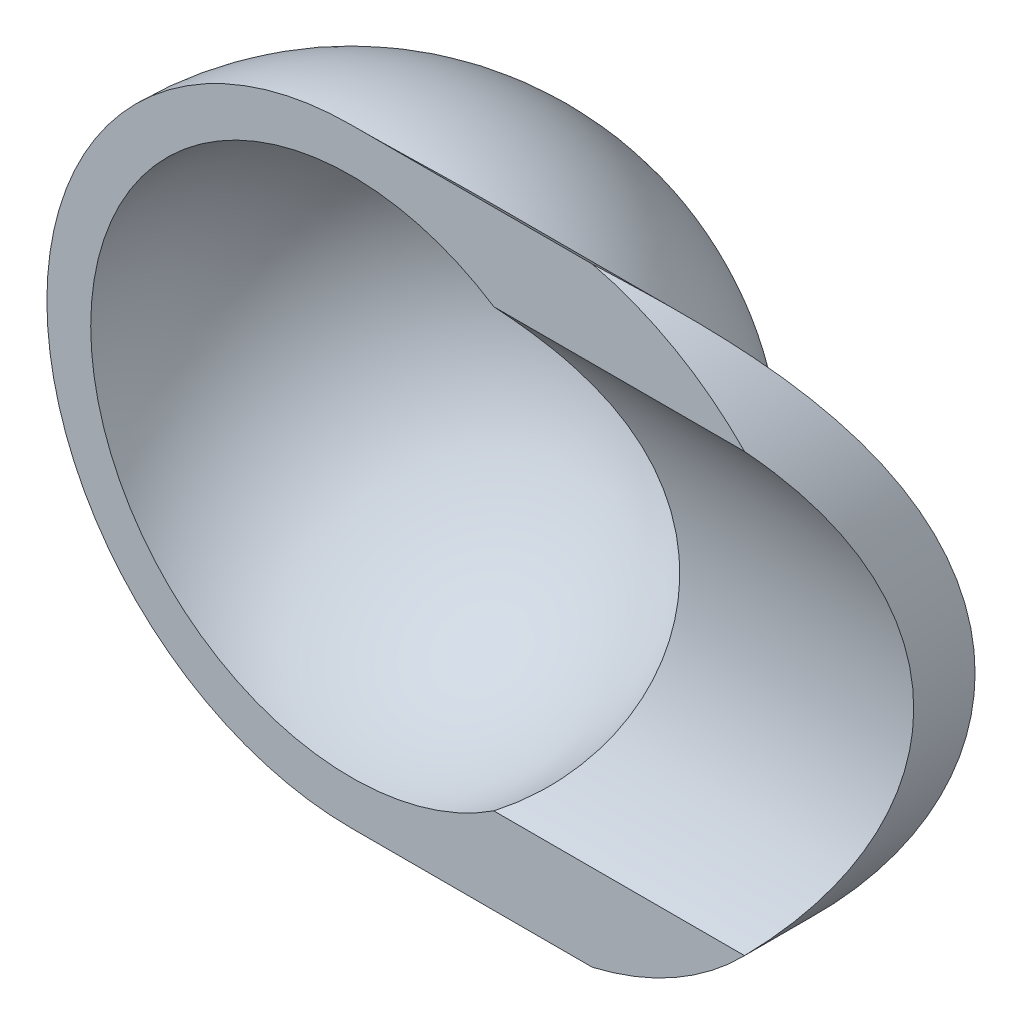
ISO-10303-21;
HEADER;
FILE_DESCRIPTION(('STEP AP214'),'2;1');
FILE_NAME('part.step','',(''),(''),'','','');
FILE_SCHEMA(('AUTOMOTIVE_DESIGN { 1 0 10303 214 1 1 1 1 }'));
ENDSEC;
DATA;
#1=APPLICATION_CONTEXT('core data for automotive mechanical design processes');
#2=APPLICATION_PROTOCOL_DEFINITION('international standard','automotive_design',2000,#1);
#3=PRODUCT_CONTEXT('',#1,'mechanical');
#4=PRODUCT('Part','Part','',(#3));
#5=PRODUCT_RELATED_PRODUCT_CATEGORY('part','',(#4));
#6=PRODUCT_DEFINITION_FORMATION('','',#4);
#7=PRODUCT_DEFINITION_CONTEXT('part definition',#1,'design');
#8=PRODUCT_DEFINITION('design','',#6,#7);
#9=PRODUCT_DEFINITION_SHAPE('','',#8);
#10=(LENGTH_UNIT() NAMED_UNIT(*) SI_UNIT(.MILLI.,.METRE.));
#11=(NAMED_UNIT(*) PLANE_ANGLE_UNIT() SI_UNIT($,.RADIAN.));
#12=(NAMED_UNIT(*) SI_UNIT($,.STERADIAN.) SOLID_ANGLE_UNIT());
#13=UNCERTAINTY_MEASURE_WITH_UNIT(LENGTH_MEASURE(1.E-05),#10,'distance_accuracy_value','');
#14=(GEOMETRIC_REPRESENTATION_CONTEXT(3) GLOBAL_UNCERTAINTY_ASSIGNED_CONTEXT((#13)) GLOBAL_UNIT_ASSIGNED_CONTEXT((#10,
#11,#12)) REPRESENTATION_CONTEXT('',''));
#15=CARTESIAN_POINT('',(0.,0.,0.));
#16=DIRECTION('',(0.,0.,1.));
#17=DIRECTION('',(1.,0.,0.));
#18=AXIS2_PLACEMENT_3D('',#15,#16,#17);
#19=CARTESIAN_POINT('',(3.087090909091,0.,-2.60742424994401));
#20=DIRECTION('',(0.,0.,1.));
#21=DIRECTION('',(0.,-1.,0.));
#22=AXIS2_PLACEMENT_3D('',#19,#20,#21);
#23=CYLINDRICAL_SURFACE('',#22,5.712909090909);
#24=CARTESIAN_POINT('',(4.4,-5.55999999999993,-4.76348440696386E-13));
#25=CARTESIAN_POINT('',(4.56212539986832,-5.52169114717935,-0.0455891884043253));
#26=CARTESIAN_POINT('',(4.72053510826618,-5.47682520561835,-0.0978044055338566));
#27=CARTESIAN_POINT('',(5.0293370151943,-5.37507600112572,-0.212101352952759));
#28=CARTESIAN_POINT('',(5.17974714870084,-5.31822117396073,-0.274159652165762));
#29=CARTESIAN_POINT('',(5.47221418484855,-5.19362034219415,-0.404772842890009));
#30=CARTESIAN_POINT('',(5.6142984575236,-5.12591311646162,-0.473304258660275));
#31=CARTESIAN_POINT('',(5.89089527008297,-4.9800075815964,-0.6145838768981));
#32=CARTESIAN_POINT('',(6.02540275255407,-4.90180238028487,-0.687334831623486));
#33=CARTESIAN_POINT('',(6.28562330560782,-4.73606387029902,-0.834259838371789));
#34=CARTESIAN_POINT('',(6.41140459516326,-4.64862078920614,-0.908415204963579));
#35=CARTESIAN_POINT('',(6.65546488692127,-4.4640175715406,-1.05709506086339));
#36=CARTESIAN_POINT('',(6.77374155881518,-4.36685444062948,-1.13161965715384));
#37=CARTESIAN_POINT('',(7.00264598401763,-4.16284598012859,-1.27959115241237));
#38=CARTESIAN_POINT('',(7.11326526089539,-4.05599021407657,-1.35303678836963));
#39=CARTESIAN_POINT('',(7.32629954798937,-3.83278441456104,-1.49737340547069));
#40=CARTESIAN_POINT('',(7.42871496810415,-3.71643485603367,-1.56826451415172));
#41=CARTESIAN_POINT('',(7.6178073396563,-3.48294130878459,-1.70127261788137));
#42=CARTESIAN_POINT('',(7.70508514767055,-3.36643601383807,-1.76365552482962));
#43=CARTESIAN_POINT('',(7.87141510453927,-3.12553819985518,-1.88398609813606));
#44=CARTESIAN_POINT('',(7.95046862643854,-3.00114700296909,-1.94193450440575));
#45=CARTESIAN_POINT('',(8.09953493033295,-2.74493567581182,-2.05226517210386));
#46=CARTESIAN_POINT('',(8.16955915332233,-2.61312525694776,-2.10465446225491));
#47=CARTESIAN_POINT('',(8.29985590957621,-2.34242653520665,-2.2028813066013));
#48=CARTESIAN_POINT('',(8.36013007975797,-2.20353942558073,-2.24871996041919));
#49=CARTESIAN_POINT('',(8.46146129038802,-1.94164543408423,-2.32623266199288));
#50=CARTESIAN_POINT('',(8.5040495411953,-1.8195533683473,-2.3590007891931));
#51=CARTESIAN_POINT('',(8.58115958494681,-1.5714353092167,-2.41855884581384));
#52=CARTESIAN_POINT('',(8.61568284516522,-1.44541003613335,-2.44534986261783));
#53=CARTESIAN_POINT('',(8.67618955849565,-1.19016906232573,-2.49243507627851));
#54=CARTESIAN_POINT('',(8.70217559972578,-1.06095434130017,-2.51273124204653));
#55=CARTESIAN_POINT('',(8.74523153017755,-0.80015075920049,-2.54641909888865));
#56=CARTESIAN_POINT('',(8.76230131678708,-0.668561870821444,-2.55981071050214));
#57=CARTESIAN_POINT('',(8.78728722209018,-0.403559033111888,-2.57942832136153));
#58=CARTESIAN_POINT('',(8.79517411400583,-0.270140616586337,-2.58563144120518));
#59=CARTESIAN_POINT('',(8.80156208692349,-0.00293903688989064,-2.59065489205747));
#60=CARTESIAN_POINT('',(8.80006314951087,0.13084412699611,-2.58947520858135));
#61=CARTESIAN_POINT('',(8.78770458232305,0.397717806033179,-2.57975944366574));
#62=CARTESIAN_POINT('',(8.77684416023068,0.530808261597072,-2.57122273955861));
#63=CARTESIAN_POINT('',(8.74594494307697,0.795251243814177,-2.54698425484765));
#64=CARTESIAN_POINT('',(8.72590631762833,0.926603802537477,-2.53128260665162));
#65=CARTESIAN_POINT('',(8.67817625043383,1.18021678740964,-2.49399496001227));
#66=CARTESIAN_POINT('',(8.65091088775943,1.30260616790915,-2.47273729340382));
#67=CARTESIAN_POINT('',(8.58873778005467,1.54428064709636,-2.42444584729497));
#68=CARTESIAN_POINT('',(8.55382742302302,1.66356466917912,-2.39741009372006));
#69=CARTESIAN_POINT('',(8.43826877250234,2.01572740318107,-2.30833316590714));
#70=CARTESIAN_POINT('',(8.34675217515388,2.24312829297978,-2.23829008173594));
#71=CARTESIAN_POINT('',(8.12800293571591,2.70137603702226,-2.07326999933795));
#72=CARTESIAN_POINT('',(7.99810838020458,2.93028021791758,-1.97649660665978));
#73=CARTESIAN_POINT('',(7.71202901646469,3.3637544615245,-1.76814903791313));
#74=CARTESIAN_POINT('',(7.55581286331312,3.5682950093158,-1.65655724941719));
#75=CARTESIAN_POINT('',(7.18592211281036,3.99140866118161,-1.40054345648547));
#76=CARTESIAN_POINT('',(6.96703683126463,4.20422787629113,-1.25408735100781));
#77=CARTESIAN_POINT('',(6.61654632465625,4.49480552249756,-1.03305545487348));
#78=CARTESIAN_POINT('',(6.4960310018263,4.5868844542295,-0.959158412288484));
#79=CARTESIAN_POINT('',(6.24764551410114,4.76143414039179,-0.812419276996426));
#80=CARTESIAN_POINT('',(6.11977830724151,4.84390871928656,-0.739576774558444));
#81=CARTESIAN_POINT('',(5.86840272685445,4.99209243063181,-0.603076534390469));
#82=CARTESIAN_POINT('',(5.74551879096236,5.05864035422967,-0.539178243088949));
#83=CARTESIAN_POINT('',(5.49365230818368,5.18319564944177,-0.415367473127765));
#84=CARTESIAN_POINT('',(5.36467342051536,5.24120806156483,-0.355452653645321));
#85=CARTESIAN_POINT('',(5.10008972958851,5.34842050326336,-0.241300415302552));
#86=CARTESIAN_POINT('',(4.96446618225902,5.39759353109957,-0.187080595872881));
#87=CARTESIAN_POINT('',(4.68688358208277,5.48627637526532,-0.0867876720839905));
#88=CARTESIAN_POINT('',(4.54491262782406,5.5257670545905,-0.0407307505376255));
#89=CARTESIAN_POINT('',(4.39999999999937,5.56000000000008,-3.01506249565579E-13));
#90=B_SPLINE_CURVE_WITH_KNOTS('',3,(#24,#25,#26,#27,#28,#29,#30,#31,#32,#33,#34,#35,#36,#37,#38,
#39,#40,#41,#42,#43,#44,#45,#46,#47,#48,#49,#50,#51,#52,#53,#54,#55,#56,#57,#58,#59,#60,#61,#62,
#63,#64,#65,#66,#67,#68,#69,#70,#71,#72,#73,#74,#75,#76,#77,#78,#79,#80,#81,#82,#83,#84,#85,#86,
#87,#88,#89),.UNSPECIFIED.,.F.,.F.,(4,2,2,2,2,2,2,2,2,2,2,2,2,2,2,2,2,2,2,2,2,2,2,2,2,2,2,2,2,2,
2,2,4),(0.,0.517448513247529,1.03368325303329,1.54811285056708,2.06288185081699,
2.57302080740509,3.08331740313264,3.59417013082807,4.1049973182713,4.57968073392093,
5.05428477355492,5.5282814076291,6.00219838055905,6.40197459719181,6.80167802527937,
7.20126016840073,7.60084690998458,8.00170198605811,8.40255784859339,8.80344764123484,
9.20433002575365,9.58544509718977,9.9666905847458,10.7285352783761,11.5668043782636,
12.406078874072,13.4178216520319,13.9236268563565,14.4292299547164,14.8898470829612,
15.3501910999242,15.8119182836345,16.2745508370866),.UNSPECIFIED.);
#91=CARTESIAN_POINT('',(4.39999999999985,-5.55999999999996,-2.78987604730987E-13));
#92=VERTEX_POINT('',#91);
#93=CARTESIAN_POINT('',(4.39999999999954,5.56000000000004,-1.91866347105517E-13));
#94=VERTEX_POINT('',#93);
#95=EDGE_CURVE('E82',#92,#94,#90,.T.);
#96=ORIENTED_EDGE('',*,*,#95,.T.);
#97=CARTESIAN_POINT('',(3.087090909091,0.,0.));
#98=DIRECTION('',(0.,0.,1.));
#99=DIRECTION('',(0.,-1.,0.));
#100=AXIS2_PLACEMENT_3D('',#97,#98,#99);
#101=CIRCLE('',#100,5.712909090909);
#102=CARTESIAN_POINT('',(7.17928218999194,3.98638944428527,0.));
#103=VERTEX_POINT('',#102);
#104=EDGE_CURVE('E66',#94,#103,#101,.F.);
#105=ORIENTED_EDGE('',*,*,#104,.T.);
#106=CARTESIAN_POINT('',(7.17928218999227,-3.98638944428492,-5.47189957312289E-13));
#107=CARTESIAN_POINT('',(7.27569314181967,-3.88738872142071,-0.0844136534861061));
#108=CARTESIAN_POINT('',(7.36928101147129,-3.78415769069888,-0.167026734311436));
#109=CARTESIAN_POINT('',(7.55030362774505,-3.56888595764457,-0.327843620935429));
#110=CARTESIAN_POINT('',(7.63772916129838,-3.45683257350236,-0.406040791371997));
#111=CARTESIAN_POINT('',(7.89077247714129,-3.10572183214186,-0.633493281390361));
#112=CARTESIAN_POINT('',(8.04577388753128,-2.85310816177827,-0.774388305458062));
#113=CARTESIAN_POINT('',(8.29409000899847,-2.36333929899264,-1.00139347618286));
#114=CARTESIAN_POINT('',(8.3935002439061,-2.13177981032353,-1.09280932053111));
#115=CARTESIAN_POINT('',(8.52021039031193,-1.77054356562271,-1.2096723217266));
#116=CARTESIAN_POINT('',(8.55868432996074,-1.64795078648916,-1.24522322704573));
#117=CARTESIAN_POINT('',(8.62763668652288,-1.39870499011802,-1.30901364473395));
#118=CARTESIAN_POINT('',(8.65811851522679,-1.27205373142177,-1.33725627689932));
#119=CARTESIAN_POINT('',(8.71075696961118,-1.0144623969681,-1.38606805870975));
#120=CARTESIAN_POINT('',(8.7328438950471,-0.883495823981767,-1.40657295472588));
#121=CARTESIAN_POINT('',(8.76789664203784,-0.61929781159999,-1.43913033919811));
#122=CARTESIAN_POINT('',(8.78086236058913,-0.486066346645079,-1.45118273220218));
#123=CARTESIAN_POINT('',(8.79739541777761,-0.218470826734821,-1.46655313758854));
#124=CARTESIAN_POINT('',(8.80095949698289,-0.0841063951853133,-1.46986812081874));
#125=CARTESIAN_POINT('',(8.7985997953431,0.18445926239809,-1.46767378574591));
#126=CARTESIAN_POINT('',(8.79267685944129,0.31866050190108,-1.4621652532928));
#127=CARTESIAN_POINT('',(8.77267184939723,0.570644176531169,-1.44357025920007));
#128=CARTESIAN_POINT('',(8.7595820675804,0.688576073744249,-1.43140549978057));
#129=CARTESIAN_POINT('',(8.72625263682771,0.922581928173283,-1.40045432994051));
#130=CARTESIAN_POINT('',(8.70601063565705,1.03865526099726,-1.38166574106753));
#131=CARTESIAN_POINT('',(8.65871061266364,1.26810619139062,-1.33780645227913));
#132=CARTESIAN_POINT('',(8.63165729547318,1.38148559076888,-1.31274008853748));
#133=CARTESIAN_POINT('',(8.57112151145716,1.60504577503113,-1.2567241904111));
#134=CARTESIAN_POINT('',(8.53763660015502,1.7152253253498,-1.22577241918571));
#135=CARTESIAN_POINT('',(8.42514282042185,2.04917296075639,-1.12195447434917));
#136=CARTESIAN_POINT('',(8.33608032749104,2.26684608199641,-1.03997448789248));
#137=CARTESIAN_POINT('',(8.13596794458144,2.68323150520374,-0.856729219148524));
#138=CARTESIAN_POINT('',(8.02488534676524,2.88191494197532,-0.75543525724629));
#139=CARTESIAN_POINT('',(7.79674455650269,3.23989572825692,-0.548874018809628));
#140=CARTESIAN_POINT('',(7.68141652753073,3.40114446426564,-0.445035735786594));
#141=CARTESIAN_POINT('',(7.4388310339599,3.70640297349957,-0.228529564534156));
#142=CARTESIAN_POINT('',(7.31163280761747,3.85049095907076,-0.115905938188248));
#143=CARTESIAN_POINT('',(7.17928218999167,3.98638944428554,0.));
#144=B_SPLINE_CURVE_WITH_KNOTS('',3,(#106,#107,#108,#109,#110,#111,#112,#113,#114,#115,#116,
#117,#118,#119,#120,#121,#122,#123,#124,#125,#126,#127,#128,#129,#130,#131,#132,#133,#134,#135,
#136,#137,#138,#139,#140,#141,#142,#143),.UNSPECIFIED.,.F.,.F.,(4,2,2,2,2,2,2,2,2,2,2,2,2,2,2,2,
2,2,4),(0.,0.485605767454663,0.971922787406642,1.95142771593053,2.75213136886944,
3.15164826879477,3.55099433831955,3.95358716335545,4.35618453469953,4.75892146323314,
5.16162252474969,5.51904402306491,5.87658318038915,6.23387605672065,6.59130500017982,
7.3354947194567,8.08079822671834,8.75099738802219,9.41801457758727),.UNSPECIFIED.);
#145=CARTESIAN_POINT('',(7.17928218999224,-3.98638944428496,-3.14517929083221E-13));
#146=VERTEX_POINT('',#145);
#147=EDGE_CURVE('E20',#146,#103,#144,.T.);
#148=ORIENTED_EDGE('',*,*,#147,.F.);
#149=CARTESIAN_POINT('',(3.087090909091,0.,0.));
#150=DIRECTION('',(0.,0.,1.));
#151=DIRECTION('',(0.,-1.,0.));
#152=AXIS2_PLACEMENT_3D('',#149,#150,#151);
#153=CIRCLE('',#152,5.712909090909);
#154=EDGE_CURVE('E64',#146,#92,#153,.F.);
#155=ORIENTED_EDGE('',*,*,#154,.T.);
#156=EDGE_LOOP('',(#96,#105,#148,#155));
#157=FACE_BOUND('',#156,.T.);
#158=ADVANCED_FACE('F16',(#157),#23,.T.);
#159=CARTESIAN_POINT('',(2.56400164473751,0.,4.674484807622));
#160=DIRECTION('',(1.,0.,0.));
#161=DIRECTION('',(0.,0.,-1.));
#162=AXIS2_PLACEMENT_3D('',#159,#160,#161);
#163=CYLINDRICAL_SURFACE('',#162,6.143460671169);
#164=ORIENTED_EDGE('',*,*,#147,.T.);
#165=DIRECTION('',(-1.,0.,0.));
#166=VECTOR('',#165,1.);
#167=CARTESIAN_POINT('',(0.809641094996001,3.986389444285,0.));
#168=LINE('',#167,#166);
#169=CARTESIAN_POINT('',(2.60121110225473,3.98638944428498,-2.55928283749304E-13));
#170=VERTEX_POINT('',#169);
#171=EDGE_CURVE('E103',#103,#170,#168,.T.);
#172=ORIENTED_EDGE('',*,*,#171,.T.);
#173=CARTESIAN_POINT('',(2.60121110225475,-3.98638944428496,-5.11765808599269E-13));
#174=CARTESIAN_POINT('',(2.70226283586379,-3.92046722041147,-0.0562411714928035));
#175=CARTESIAN_POINT('',(2.79973543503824,-3.85018123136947,-0.113750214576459));
#176=CARTESIAN_POINT('',(2.98728495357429,-3.70115915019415,-0.229838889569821));
#177=CARTESIAN_POINT('',(3.07736275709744,-3.62242407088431,-0.288418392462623));
#178=CARTESIAN_POINT('',(3.25000448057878,-3.45667420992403,-0.405261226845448));
#179=CARTESIAN_POINT('',(3.33256002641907,-3.36965041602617,-0.463524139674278));
#180=CARTESIAN_POINT('',(3.48986226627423,-3.18775187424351,-0.578315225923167));
#181=CARTESIAN_POINT('',(3.56460893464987,-3.09287710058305,-0.63484339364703));
#182=CARTESIAN_POINT('',(3.70618429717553,-2.89562389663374,-0.744947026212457));
#183=CARTESIAN_POINT('',(3.77300555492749,-2.79323856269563,-0.798519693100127));
#184=CARTESIAN_POINT('',(3.89847846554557,-2.58158587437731,-0.901478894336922));
#185=CARTESIAN_POINT('',(3.95713030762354,-2.47231867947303,-0.95086552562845));
#186=CARTESIAN_POINT('',(4.06604914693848,-2.24765490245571,-1.04433893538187));
#187=CARTESIAN_POINT('',(4.1163238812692,-2.13226410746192,-1.08843059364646));
#188=CARTESIAN_POINT('',(4.20839368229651,-1.89602359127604,-1.17041329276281));
#189=CARTESIAN_POINT('',(4.25018907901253,-1.77517408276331,-1.20830457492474));
#190=CARTESIAN_POINT('',(4.32401664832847,-1.53262412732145,-1.2760229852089));
#191=CARTESIAN_POINT('',(4.35630653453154,-1.41106070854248,-1.30605987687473));
#192=CARTESIAN_POINT('',(4.41265861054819,-1.16450816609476,-1.35891578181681));
#193=CARTESIAN_POINT('',(4.43672128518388,-1.03951924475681,-1.38173522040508));
#194=CARTESIAN_POINT('',(4.47652963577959,-0.787058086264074,-1.41968821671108));
#195=CARTESIAN_POINT('',(4.49227442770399,-0.659585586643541,-1.4348209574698));
#196=CARTESIAN_POINT('',(4.51537828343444,-0.403191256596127,-1.45708118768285));
#197=CARTESIAN_POINT('',(4.52273771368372,-0.274269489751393,-1.46420902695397));
#198=CARTESIAN_POINT('',(4.52886341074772,-0.0233274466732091,-1.47014032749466));
#199=CARTESIAN_POINT('',(4.52809147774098,0.0986714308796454,-1.46939114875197));
#200=CARTESIAN_POINT('',(4.51905825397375,0.342172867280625,-1.46064947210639));
#201=CARTESIAN_POINT('',(4.5107945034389,0.463675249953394,-1.45265459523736));
#202=CARTESIAN_POINT('',(4.48681244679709,0.705182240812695,-1.42957394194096));
#203=CARTESIAN_POINT('',(4.47109883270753,0.825187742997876,-1.41449262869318));
#204=CARTESIAN_POINT('',(4.43226882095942,1.06297190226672,-1.37751338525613));
#205=CARTESIAN_POINT('',(4.40914979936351,1.18074975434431,-1.35561303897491));
#206=CARTESIAN_POINT('',(4.35583315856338,1.41217703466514,-1.30562832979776));
#207=CARTESIAN_POINT('',(4.32570151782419,1.52585418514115,-1.27760174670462));
#208=CARTESIAN_POINT('',(4.25834332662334,1.74946980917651,-1.2157547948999));
#209=CARTESIAN_POINT('',(4.22111651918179,1.85940814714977,-1.18193421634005));
#210=CARTESIAN_POINT('',(4.13965503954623,2.07494544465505,-1.10908319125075));
#211=CARTESIAN_POINT('',(4.0954165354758,2.18054199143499,-1.07004989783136));
#212=CARTESIAN_POINT('',(4.00007765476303,2.38672056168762,-0.987493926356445));
#213=CARTESIAN_POINT('',(3.94897911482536,2.48730391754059,-0.9439724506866));
#214=CARTESIAN_POINT('',(3.83757105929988,2.68740264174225,-0.851153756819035));
#215=CARTESIAN_POINT('',(3.77694980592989,2.78666468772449,-0.80168447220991));
#216=CARTESIAN_POINT('',(3.64849732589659,2.97867106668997,-0.69966110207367));
#217=CARTESIAN_POINT('',(3.58066824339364,3.07141732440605,-0.647107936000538));
#218=CARTESIAN_POINT('',(3.43798247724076,3.24995464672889,-0.53998872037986));
#219=CARTESIAN_POINT('',(3.36313081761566,3.33575060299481,-0.485424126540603));
#220=CARTESIAN_POINT('',(3.20653797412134,3.50010048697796,-0.375384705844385));
#221=CARTESIAN_POINT('',(3.12479951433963,3.57865725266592,-0.319910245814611));
#222=CARTESIAN_POINT('',(2.97088561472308,3.71396180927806,-0.219823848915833));
#223=CARTESIAN_POINT('',(2.89987511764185,3.77200564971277,-0.175165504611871));
#224=CARTESIAN_POINT('',(2.75367312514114,3.8830050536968,-0.0867569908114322));
#225=CARTESIAN_POINT('',(2.67848857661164,3.93596869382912,-0.0430054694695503));
#226=CARTESIAN_POINT('',(2.6012111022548,3.98638944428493,-4.37123210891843E-13));
#227=B_SPLINE_CURVE_WITH_KNOTS('',3,(#173,#174,#175,#176,#177,#178,#179,#180,#181,#182,#183,
#184,#185,#186,#187,#188,#189,#190,#191,#192,#193,#194,#195,#196,#197,#198,#199,#200,#201,#202,
#203,#204,#205,#206,#207,#208,#209,#210,#211,#212,#213,#214,#215,#216,#217,#218,#219,#220,#221,
#222,#223,#224,#225,#226),.UNSPECIFIED.,.F.,.F.,(4,2,2,2,2,2,2,2,2,2,2,2,2,2,2,2,2,2,2,2,2,2,2,
2,2,2,4),(0.,0.399200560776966,0.798353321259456,1.1979451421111,1.59753827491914,
1.99750342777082,2.39745931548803,2.79704373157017,3.19661259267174,3.58406015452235,
3.97148488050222,4.35895077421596,4.74639973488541,5.11196883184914,5.47765799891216,
5.84311715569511,6.20870594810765,6.57098500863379,6.93327719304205,7.29576805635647,
7.65816205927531,8.03692033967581,8.41556626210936,8.79394333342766,9.17217143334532,
9.4779909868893,9.78331599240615),.UNSPECIFIED.);
#228=CARTESIAN_POINT('',(2.60121110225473,-3.98638944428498,-2.56592357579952E-13));
#229=VERTEX_POINT('',#228);
#230=EDGE_CURVE('E71',#229,#170,#227,.T.);
#231=ORIENTED_EDGE('',*,*,#230,.F.);
#232=DIRECTION('',(1.,0.,0.));
#233=VECTOR('',#232,1.);
#234=CARTESIAN_POINT('',(0.809641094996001,-3.986389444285,0.));
#235=LINE('',#234,#233);
#236=EDGE_CURVE('E75',#229,#146,#235,.T.);
#237=ORIENTED_EDGE('',*,*,#236,.T.);
#238=EDGE_LOOP('',(#164,#172,#231,#237));
#239=FACE_BOUND('',#238,.T.);
#240=ADVANCED_FACE('F80',(#239),#163,.F.);
#241=CARTESIAN_POINT('',(0.,0.,0.));
#242=DIRECTION('',(0.,0.,-1.));
#243=DIRECTION('',(-1.,0.,0.));
#244=AXIS2_PLACEMENT_3D('',#241,#242,#243);
#245=SPHERICAL_SURFACE('',#244,4.76);
#246=ORIENTED_EDGE('',*,*,#230,.T.);
#247=CARTESIAN_POINT('',(0.,0.,0.));
#248=DIRECTION('',(0.,0.,-1.));
#249=DIRECTION('',(-1.,0.,0.));
#250=AXIS2_PLACEMENT_3D('',#247,#248,#249);
#251=CIRCLE('',#250,4.76);
#252=EDGE_CURVE('E101',#170,#229,#251,.F.);
#253=ORIENTED_EDGE('',*,*,#252,.T.);
#254=EDGE_LOOP('',(#246,#253));
#255=FACE_BOUND('',#254,.T.);
#256=CARTESIAN_POINT('',(0.,0.,-4.76));
#257=VERTEX_POINT('',#256);
#258=VERTEX_LOOP('',#257);
#259=FACE_BOUND('',#258,.T.);
#260=ADVANCED_FACE('F116',(#255,#259),#245,.F.);
#261=CARTESIAN_POINT('',(-0.0528185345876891,0.,4.674484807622));
#262=DIRECTION('',(1.,0.,0.));
#263=DIRECTION('',(0.,0.,-1.));
#264=AXIS2_PLACEMENT_3D('',#261,#262,#263);
#265=CYLINDRICAL_SURFACE('',#264,7.263911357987);
#266=CARTESIAN_POINT('',(2.38320174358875E-07,-5.55999999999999,-3.97495621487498E-13));
#267=CARTESIAN_POINT('',(0.0584975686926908,-5.55999996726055,2.07959565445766E-06));
#268=CARTESIAN_POINT('',(0.116985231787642,-5.55907662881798,-0.00109854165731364));
#269=CARTESIAN_POINT('',(0.233815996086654,-5.55538670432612,-0.00548301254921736));
#270=CARTESIAN_POINT('',(0.292159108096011,-5.5526202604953,-0.00876669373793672));
#271=CARTESIAN_POINT('',(0.46665467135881,-5.54157013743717,-0.0218486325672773));
#272=CARTESIAN_POINT('',(0.582417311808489,-5.53053564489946,-0.0348778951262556));
#273=CARTESIAN_POINT('',(0.810742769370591,-5.50136042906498,-0.0689246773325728));
#274=CARTESIAN_POINT('',(0.923324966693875,-5.48328428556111,-0.0898695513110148));
#275=CARTESIAN_POINT('',(1.14553844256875,-5.44016769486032,-0.139043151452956));
#276=CARTESIAN_POINT('',(1.25516918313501,-5.41512598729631,-0.167273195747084));
#277=CARTESIAN_POINT('',(1.4703522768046,-5.35836440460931,-0.230014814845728));
#278=CARTESIAN_POINT('',(1.57591854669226,-5.32667027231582,-0.264502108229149));
#279=CARTESIAN_POINT('',(1.78292224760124,-5.25673800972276,-0.338869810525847));
#280=CARTESIAN_POINT('',(1.88435785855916,-5.21849703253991,-0.378752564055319));
#281=CARTESIAN_POINT('',(2.18218882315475,-5.09409941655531,-0.505139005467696));
#282=CARTESIAN_POINT('',(2.37185365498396,-4.99833556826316,-0.598302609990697));
#283=CARTESIAN_POINT('',(2.74537962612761,-4.77445114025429,-0.802165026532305));
#284=CARTESIAN_POINT('',(2.9276080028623,-4.64437659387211,-0.913666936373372));
#285=CARTESIAN_POINT('',(3.2684076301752,-4.35829855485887,-1.13953311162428));
#286=CARTESIAN_POINT('',(3.42697800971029,-4.20229410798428,-1.25389748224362));
#287=CARTESIAN_POINT('',(3.66076553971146,-3.93471992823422,-1.43263112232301));
#288=CARTESIAN_POINT('',(3.74372292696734,-3.83075786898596,-1.49848193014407));
#289=CARTESIAN_POINT('',(3.90125070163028,-3.61493116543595,-1.62729685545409));
#290=CARTESIAN_POINT('',(3.97582015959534,-3.50306564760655,-1.6902606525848));
#291=CARTESIAN_POINT('',(4.11657138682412,-3.27197059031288,-1.81209327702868));
#292=CARTESIAN_POINT('',(4.18274856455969,-3.15273707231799,-1.87095985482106));
#293=CARTESIAN_POINT('',(4.3066842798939,-2.90754868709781,-1.98350074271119));
#294=CARTESIAN_POINT('',(4.36443904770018,-2.78159084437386,-2.0371727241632));
#295=CARTESIAN_POINT('',(4.47432138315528,-2.51684708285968,-2.14102449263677));
#296=CARTESIAN_POINT('',(4.52598514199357,-2.37773525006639,-2.19086582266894));
#297=CARTESIAN_POINT('',(4.61984175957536,-2.09390969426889,-2.28268330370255));
#298=CARTESIAN_POINT('',(4.66203881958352,-1.94919848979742,-2.32466294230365));
#299=CARTESIAN_POINT('',(4.73689776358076,-1.65533821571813,-2.3999223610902));
#300=CARTESIAN_POINT('',(4.76957237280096,-1.50619536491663,-2.43321374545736));
#301=CARTESIAN_POINT('',(4.825408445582,-1.20445000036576,-2.49051906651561));
#302=CARTESIAN_POINT('',(4.84857387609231,-1.05184895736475,-2.51453687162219));
#303=CARTESIAN_POINT('',(4.88471155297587,-0.749855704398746,-2.55216291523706));
#304=CARTESIAN_POINT('',(4.89802182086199,-0.600546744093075,-2.56611588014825));
#305=CARTESIAN_POINT('',(4.91577120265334,-0.300825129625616,-2.58474766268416));
#306=CARTESIAN_POINT('',(4.92021035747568,-0.150412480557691,-2.58942652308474));
#307=CARTESIAN_POINT('',(4.92021039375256,0.150473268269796,-2.58942657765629));
#308=CARTESIAN_POINT('',(4.91576768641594,0.300946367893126,-2.58474398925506));
#309=CARTESIAN_POINT('',(4.89800062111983,0.600842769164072,-2.5660936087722));
#310=CARTESIAN_POINT('',(4.88467304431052,0.750265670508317,-2.55212245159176));
#311=CARTESIAN_POINT('',(4.84912823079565,1.04712776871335,-2.51511442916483));
#312=CARTESIAN_POINT('',(4.8268986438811,1.19456391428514,-2.49206496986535));
#313=CARTESIAN_POINT('',(4.7735794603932,1.48619507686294,-2.43731140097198));
#314=CARTESIAN_POINT('',(4.74248949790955,1.6303899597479,-2.40560693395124));
#315=CARTESIAN_POINT('',(4.67155365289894,1.91427244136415,-2.33417788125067));
#316=CARTESIAN_POINT('',(4.63172417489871,2.05396792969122,-2.29446833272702));
#317=CARTESIAN_POINT('',(4.54331451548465,2.32821348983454,-2.20770348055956));
#318=CARTESIAN_POINT('',(4.49473415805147,2.46276345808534,-2.1606480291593));
#319=CARTESIAN_POINT('',(4.38887780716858,2.72582531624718,-2.06006103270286));
#320=CARTESIAN_POINT('',(4.33160481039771,2.85433926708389,-2.00653172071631));
#321=CARTESIAN_POINT('',(4.20837846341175,3.10461906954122,-1.89396840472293));
#322=CARTESIAN_POINT('',(4.14242485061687,3.22638471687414,-1.83493423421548));
#323=CARTESIAN_POINT('',(4.00024515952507,3.46518854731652,-1.71107537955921));
#324=CARTESIAN_POINT('',(3.92381841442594,3.58205459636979,-1.64614904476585));
#325=CARTESIAN_POINT('',(3.76190855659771,3.80736354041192,-1.51304397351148));
#326=CARTESIAN_POINT('',(3.67642517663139,3.91580618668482,-1.44486514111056));
#327=CARTESIAN_POINT('',(3.49630643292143,4.12380595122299,-1.30667223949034));
#328=CARTESIAN_POINT('',(3.40166106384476,4.22335312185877,-1.2366562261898));
#329=CARTESIAN_POINT('',(3.20332023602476,4.41289971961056,-1.0965301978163));
#330=CARTESIAN_POINT('',(3.09962559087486,4.50290000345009,-1.02642019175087));
#331=CARTESIAN_POINT('',(2.88211909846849,4.67375981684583,-0.88722750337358));
#332=CARTESIAN_POINT('',(2.76821416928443,4.75451581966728,-0.818162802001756));
#333=CARTESIAN_POINT('',(2.53134770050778,4.90534293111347,-0.683893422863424));
#334=CARTESIAN_POINT('',(2.40838480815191,4.97541243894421,-0.618689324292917));
#335=CARTESIAN_POINT('',(2.15400919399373,5.10425226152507,-0.494558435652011));
#336=CARTESIAN_POINT('',(2.02261330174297,5.16304420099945,-0.435619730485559));
#337=CARTESIAN_POINT('',(1.75183907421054,5.2689917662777,-0.326308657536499));
#338=CARTESIAN_POINT('',(1.61246566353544,5.31615447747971,-0.275931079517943));
#339=CARTESIAN_POINT('',(1.37251224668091,5.38523727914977,-0.200486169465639));
#340=CARTESIAN_POINT('',(1.27377639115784,5.41040689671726,-0.172476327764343));
#341=CARTESIAN_POINT('',(1.07359085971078,5.45501640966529,-0.122215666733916));
#342=CARTESIAN_POINT('',(0.972141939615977,5.474457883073,-0.0999632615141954));
#343=CARTESIAN_POINT('',(0.767353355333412,5.5074530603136,-0.0618644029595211));
#344=CARTESIAN_POINT('',(0.664018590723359,5.52102023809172,-0.0460032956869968));
#345=CARTESIAN_POINT('',(0.455968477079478,5.54223102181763,-0.021082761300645));
#346=CARTESIAN_POINT('',(0.351253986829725,5.54987815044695,-0.0120192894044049));
#347=CARTESIAN_POINT('',(0.20525872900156,5.5563604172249,-0.00432616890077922));
#348=CARTESIAN_POINT('',(0.164219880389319,5.55772559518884,-0.00270413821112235));
#349=CARTESIAN_POINT('',(0.082122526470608,5.5595449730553,-0.000541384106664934));
#350=CARTESIAN_POINT('',(0.0410640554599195,5.55999981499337,1.01386837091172E-07));
#351=CARTESIAN_POINT('',(4.60482935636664E-07,5.55999999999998,-2.53865938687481E-13));
#352=B_SPLINE_CURVE_WITH_KNOTS('',3,(#266,#267,#268,#269,#270,#271,#272,#273,#274,#275,#276,
#277,#278,#279,#280,#281,#282,#283,#284,#285,#286,#287,#288,#289,#290,#291,#292,#293,#294,#295,
#296,#297,#298,#299,#300,#301,#302,#303,#304,#305,#306,#307,#308,#309,#310,#311,#312,#313,#314,
#315,#316,#317,#318,#319,#320,#321,#322,#323,#324,#325,#326,#327,#328,#329,#330,#331,#332,#333,
#334,#335,#336,#337,#338,#339,#340,#341,#342,#343,#344,#345,#346,#347,#348,#349,#350,#351),
.UNSPECIFIED.,.F.,.F.,(4,2,2,2,2,2,2,2,2,2,2,2,2,2,2,2,2,2,2,2,2,2,2,2,2,2,2,2,2,2,2,2,2,2,2,2,
2,2,2,2,2,2,4),(0.,0.175455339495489,0.350897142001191,0.701350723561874,1.04866318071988,
1.39603852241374,1.74209362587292,2.08829959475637,2.78152671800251,3.52933582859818,
4.2771724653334,4.72199745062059,5.16687167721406,5.61198825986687,6.05730346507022,
6.52634656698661,6.99518109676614,7.46338620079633,7.93139578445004,8.38249720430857,
8.83359654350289,9.28487819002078,9.73632341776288,10.1883971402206,10.6404895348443,
11.0917404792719,11.5430005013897,11.9941053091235,12.4452237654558,12.9066737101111,
13.3681372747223,13.8301105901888,14.2920424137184,14.7587249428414,15.2254773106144,
15.6913255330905,16.1568892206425,16.4736000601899,16.7902235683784,17.1061169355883,
17.421822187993,17.5450836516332,17.6682581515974),.UNSPECIFIED.);
#353=CARTESIAN_POINT('',(1.19160087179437E-07,-5.56,-1.98747810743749E-13));
#354=VERTEX_POINT('',#353);
#355=CARTESIAN_POINT('',(2.30241455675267E-07,5.55999999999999,-2.071232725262E-13));
#356=VERTEX_POINT('',#355);
#357=EDGE_CURVE('E31',#354,#356,#352,.T.);
#358=ORIENTED_EDGE('',*,*,#357,.T.);
#359=DIRECTION('',(1.,0.,0.));
#360=VECTOR('',#359,1.);
#361=CARTESIAN_POINT('',(0.809641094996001,5.56,0.));
#362=LINE('',#361,#360);
#363=EDGE_CURVE('E104',#356,#94,#362,.T.);
#364=ORIENTED_EDGE('',*,*,#363,.T.);
#365=ORIENTED_EDGE('',*,*,#95,.F.);
#366=DIRECTION('',(-1.,0.,0.));
#367=VECTOR('',#366,1.);
#368=CARTESIAN_POINT('',(0.809641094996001,-5.56,0.));
#369=LINE('',#368,#367);
#370=EDGE_CURVE('E77',#92,#354,#369,.T.);
#371=ORIENTED_EDGE('',*,*,#370,.T.);
#372=EDGE_LOOP('',(#358,#364,#365,#371));
#373=FACE_BOUND('',#372,.T.);
#374=ADVANCED_FACE('F94',(#373),#265,.T.);
#375=CARTESIAN_POINT('',(-5.8147856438,5.7824,0.));
#376=DIRECTION('',(0.,0.,-1.));
#377=DIRECTION('',(1.,0.,0.));
#378=AXIS2_PLACEMENT_3D('',#375,#376,#377);
#379=PLANE('',#378);
#380=ORIENTED_EDGE('',*,*,#252,.F.);
#381=ORIENTED_EDGE('',*,*,#171,.F.);
#382=ORIENTED_EDGE('',*,*,#104,.F.);
#383=ORIENTED_EDGE('',*,*,#363,.F.);
#384=CARTESIAN_POINT('',(0.,0.,0.));
#385=DIRECTION('',(0.,0.,-1.));
#386=DIRECTION('',(-1.,0.,0.));
#387=AXIS2_PLACEMENT_3D('',#384,#385,#386);
#388=CIRCLE('',#387,5.56);
#389=EDGE_CURVE('E10',#356,#354,#388,.F.);
#390=ORIENTED_EDGE('',*,*,#389,.T.);
#391=ORIENTED_EDGE('',*,*,#370,.F.);
#392=ORIENTED_EDGE('',*,*,#154,.F.);
#393=ORIENTED_EDGE('',*,*,#236,.F.);
#394=EDGE_LOOP('',(#380,#381,#382,#383,#390,#391,#392,#393));
#395=FACE_BOUND('',#394,.T.);
#396=ADVANCED_FACE('F18',(#395),#379,.F.);
#397=CARTESIAN_POINT('',(0.,0.,0.));
#398=DIRECTION('',(0.,0.,-1.));
#399=DIRECTION('',(-1.,0.,0.));
#400=AXIS2_PLACEMENT_3D('',#397,#398,#399);
#401=SPHERICAL_SURFACE('',#400,5.56);
#402=CARTESIAN_POINT('',(0.,0.,-5.56));
#403=VERTEX_POINT('',#402);
#404=VERTEX_LOOP('',#403);
#405=FACE_BOUND('',#404,.T.);
#406=ORIENTED_EDGE('',*,*,#389,.F.);
#407=ORIENTED_EDGE('',*,*,#357,.F.);
#408=EDGE_LOOP('',(#406,#407));
#409=FACE_BOUND('',#408,.T.);
#410=ADVANCED_FACE('F90',(#405,#409),#401,.T.);
#411=CLOSED_SHELL('',(#158,#240,#260,#374,#396,#410));
#412=MANIFOLD_SOLID_BREP('B1',#411);
#413=ADVANCED_BREP_SHAPE_REPRESENTATION('',(#18,#412),#14);
#414=SHAPE_DEFINITION_REPRESENTATION(#9,#413);
ENDSEC;
END-ISO-10303-21;
